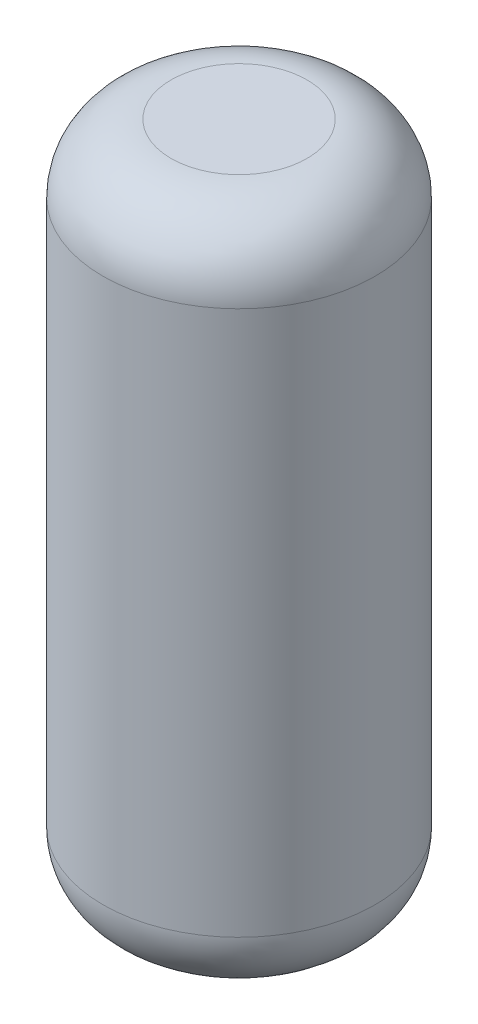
ISO-10303-21;
HEADER;
FILE_DESCRIPTION(('STEP AP214'),'2;1');
FILE_NAME('part.step','',(''),(''),'','','');
FILE_SCHEMA(('AUTOMOTIVE_DESIGN { 1 0 10303 214 1 1 1 1 }'));
ENDSEC;
DATA;
#1=APPLICATION_CONTEXT('core data for automotive mechanical design processes');
#2=APPLICATION_PROTOCOL_DEFINITION('international standard','automotive_design',2000,#1);
#3=PRODUCT_CONTEXT('',#1,'mechanical');
#4=PRODUCT('Part','Part','',(#3));
#5=PRODUCT_RELATED_PRODUCT_CATEGORY('part','',(#4));
#6=PRODUCT_DEFINITION_FORMATION('','',#4);
#7=PRODUCT_DEFINITION_CONTEXT('part definition',#1,'design');
#8=PRODUCT_DEFINITION('design','',#6,#7);
#9=PRODUCT_DEFINITION_SHAPE('','',#8);
#10=(LENGTH_UNIT() NAMED_UNIT(*) SI_UNIT(.MILLI.,.METRE.));
#11=(NAMED_UNIT(*) PLANE_ANGLE_UNIT() SI_UNIT($,.RADIAN.));
#12=(NAMED_UNIT(*) SI_UNIT($,.STERADIAN.) SOLID_ANGLE_UNIT());
#13=UNCERTAINTY_MEASURE_WITH_UNIT(LENGTH_MEASURE(1.E-05),#10,'distance_accuracy_value','');
#14=(GEOMETRIC_REPRESENTATION_CONTEXT(3) GLOBAL_UNCERTAINTY_ASSIGNED_CONTEXT((#13)) GLOBAL_UNIT_ASSIGNED_CONTEXT((#10,
#11,#12)) REPRESENTATION_CONTEXT('',''));
#15=CARTESIAN_POINT('',(0.,0.,0.));
#16=DIRECTION('',(0.,0.,1.));
#17=DIRECTION('',(1.,0.,0.));
#18=AXIS2_PLACEMENT_3D('',#15,#16,#17);
#19=CARTESIAN_POINT('',(0.,10.,0.));
#20=DIRECTION('',(0.,-1.,0.));
#21=DIRECTION('',(0.,0.,-1.));
#22=AXIS2_PLACEMENT_3D('',#19,#20,#21);
#23=CYLINDRICAL_SURFACE('',#22,2.);
#24=CARTESIAN_POINT('',(0.,9.,0.));
#25=DIRECTION('',(0.,1.,0.));
#26=DIRECTION('',(0.,0.,1.));
#27=AXIS2_PLACEMENT_3D('',#24,#25,#26);
#28=CIRCLE('',#27,2.);
#29=CARTESIAN_POINT('',(0.,9.,2.));
#30=VERTEX_POINT('',#29);
#31=EDGE_CURVE('E38',#30,#30,#28,.F.);
#32=ORIENTED_EDGE('',*,*,#31,.T.);
#33=EDGE_LOOP('',(#32));
#34=FACE_BOUND('',#33,.T.);
#35=CARTESIAN_POINT('',(0.,0.999999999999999,0.));
#36=DIRECTION('',(0.,1.,0.));
#37=DIRECTION('',(0.,0.,1.));
#38=AXIS2_PLACEMENT_3D('',#35,#36,#37);
#39=CIRCLE('',#38,2.);
#40=CARTESIAN_POINT('',(0.,0.999999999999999,2.));
#41=VERTEX_POINT('',#40);
#42=EDGE_CURVE('E42',#41,#41,#39,.T.);
#43=ORIENTED_EDGE('',*,*,#42,.T.);
#44=EDGE_LOOP('',(#43));
#45=FACE_BOUND('',#44,.T.);
#46=ADVANCED_FACE('F31',(#34,#45),#23,.T.);
#47=CARTESIAN_POINT('',(0.,10.,0.));
#48=DIRECTION('',(0.,1.,0.));
#49=DIRECTION('',(0.,0.,1.));
#50=AXIS2_PLACEMENT_3D('',#47,#48,#49);
#51=PLANE('',#50);
#52=CARTESIAN_POINT('',(0.,10.,0.));
#53=DIRECTION('',(0.,1.,0.));
#54=DIRECTION('',(0.,0.,1.));
#55=AXIS2_PLACEMENT_3D('',#52,#53,#54);
#56=CIRCLE('',#55,1.);
#57=CARTESIAN_POINT('',(0.,10.,1.));
#58=VERTEX_POINT('',#57);
#59=EDGE_CURVE('E46',#58,#58,#56,.T.);
#60=ORIENTED_EDGE('',*,*,#59,.T.);
#61=EDGE_LOOP('',(#60));
#62=FACE_BOUND('',#61,.T.);
#63=ADVANCED_FACE('F52',(#62),#51,.T.);
#64=CARTESIAN_POINT('',(0.,0.,0.));
#65=DIRECTION('',(0.,1.,0.));
#66=DIRECTION('',(0.,0.,1.));
#67=AXIS2_PLACEMENT_3D('',#64,#65,#66);
#68=PLANE('',#67);
#69=CARTESIAN_POINT('',(0.,0.,0.));
#70=DIRECTION('',(0.,1.,0.));
#71=DIRECTION('',(0.,0.,1.));
#72=AXIS2_PLACEMENT_3D('',#69,#70,#71);
#73=CIRCLE('',#72,1.);
#74=CARTESIAN_POINT('',(0.,0.,1.));
#75=VERTEX_POINT('',#74);
#76=EDGE_CURVE('E10',#75,#75,#73,.F.);
#77=ORIENTED_EDGE('',*,*,#76,.T.);
#78=EDGE_LOOP('',(#77));
#79=FACE_BOUND('',#78,.T.);
#80=ADVANCED_FACE('F56',(#79),#68,.F.);
#81=CARTESIAN_POINT('',(0.,9.,0.));
#82=DIRECTION('',(0.,1.,0.));
#83=DIRECTION('',(0.,0.,1.));
#84=AXIS2_PLACEMENT_3D('',#81,#82,#83);
#85=DEGENERATE_TOROIDAL_SURFACE('',#84,1.,1.,.T.);
#86=ORIENTED_EDGE('',*,*,#31,.F.);
#87=EDGE_LOOP('',(#86));
#88=FACE_BOUND('',#87,.T.);
#89=ORIENTED_EDGE('',*,*,#59,.F.);
#90=EDGE_LOOP('',(#89));
#91=FACE_BOUND('',#90,.T.);
#92=ADVANCED_FACE('F54',(#88,#91),#85,.T.);
#93=CARTESIAN_POINT('',(0.,0.999999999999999,0.));
#94=DIRECTION('',(0.,1.,0.));
#95=DIRECTION('',(0.,0.,1.));
#96=AXIS2_PLACEMENT_3D('',#93,#94,#95);
#97=DEGENERATE_TOROIDAL_SURFACE('',#96,1.,1.,.T.);
#98=ORIENTED_EDGE('',*,*,#76,.F.);
#99=EDGE_LOOP('',(#98));
#100=FACE_BOUND('',#99,.T.);
#101=ORIENTED_EDGE('',*,*,#42,.F.);
#102=EDGE_LOOP('',(#101));
#103=FACE_BOUND('',#102,.T.);
#104=ADVANCED_FACE('F33',(#100,#103),#97,.T.);
#105=CLOSED_SHELL('',(#46,#63,#80,#92,#104));
#106=MANIFOLD_SOLID_BREP('B2',#105);
#107=ADVANCED_BREP_SHAPE_REPRESENTATION('',(#18,#106),#14);
#108=SHAPE_DEFINITION_REPRESENTATION(#9,#107);
ENDSEC;
END-ISO-10303-21;
